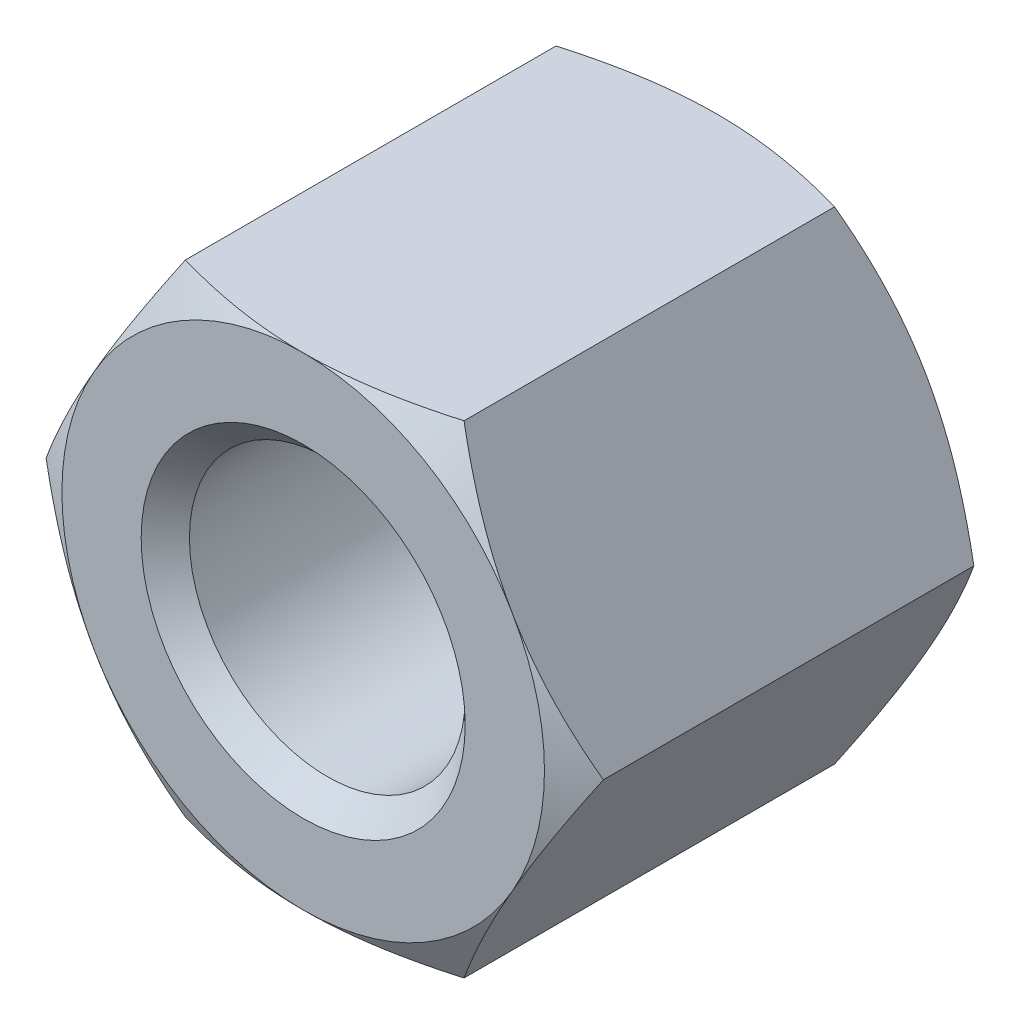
ISO-10303-21;
HEADER;
FILE_DESCRIPTION(('STEP AP214'),'2;1');
FILE_NAME('part.step','',(''),(''),'','','');
FILE_SCHEMA(('AUTOMOTIVE_DESIGN { 1 0 10303 214 1 1 1 1 }'));
ENDSEC;
DATA;
#1=APPLICATION_CONTEXT('core data for automotive mechanical design processes');
#2=APPLICATION_PROTOCOL_DEFINITION('international standard','automotive_design',2000,#1);
#3=PRODUCT_CONTEXT('',#1,'mechanical');
#4=PRODUCT('Part','Part','',(#3));
#5=PRODUCT_RELATED_PRODUCT_CATEGORY('part','',(#4));
#6=PRODUCT_DEFINITION_FORMATION('','',#4);
#7=PRODUCT_DEFINITION_CONTEXT('part definition',#1,'design');
#8=PRODUCT_DEFINITION('design','',#6,#7);
#9=PRODUCT_DEFINITION_SHAPE('','',#8);
#10=(LENGTH_UNIT() NAMED_UNIT(*) SI_UNIT(.MILLI.,.METRE.));
#11=(NAMED_UNIT(*) PLANE_ANGLE_UNIT() SI_UNIT($,.RADIAN.));
#12=(NAMED_UNIT(*) SI_UNIT($,.STERADIAN.) SOLID_ANGLE_UNIT());
#13=UNCERTAINTY_MEASURE_WITH_UNIT(LENGTH_MEASURE(1.E-05),#10,'distance_accuracy_value','');
#14=(GEOMETRIC_REPRESENTATION_CONTEXT(3) GLOBAL_UNCERTAINTY_ASSIGNED_CONTEXT((#13)) GLOBAL_UNIT_ASSIGNED_CONTEXT((#10,
#11,#12)) REPRESENTATION_CONTEXT('',''));
#15=CARTESIAN_POINT('',(0.,0.,0.));
#16=DIRECTION('',(0.,0.,1.));
#17=DIRECTION('',(1.,0.,0.));
#18=AXIS2_PLACEMENT_3D('',#15,#16,#17);
#19=CARTESIAN_POINT('',(4.04145188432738,0.,-3.));
#20=DIRECTION('',(0.866025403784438,0.5,0.));
#21=DIRECTION('',(-0.5,0.866025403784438,0.));
#22=AXIS2_PLACEMENT_3D('',#19,#20,#21);
#23=PLANE('',#22);
#24=CARTESIAN_POINT('',(4.04156735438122,-0.00019999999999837,2.68732593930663));
#25=CARTESIAN_POINT('',(3.9527667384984,0.153607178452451,2.73861421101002));
#26=CARTESIAN_POINT('',(3.86319960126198,0.308742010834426,2.7852590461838));
#27=CARTESIAN_POINT('',(3.68251437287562,0.621698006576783,2.86667812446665));
#28=CARTESIAN_POINT('',(3.59139307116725,0.779524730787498,2.90142356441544));
#29=CARTESIAN_POINT('',(3.41027974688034,1.09322221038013,2.95550997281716));
#30=CARTESIAN_POINT('',(3.32031559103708,1.24904469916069,2.97521091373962));
#31=CARTESIAN_POINT('',(3.13996396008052,1.56142288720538,2.99872986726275));
#32=CARTESIAN_POINT('',(3.04957714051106,1.71797745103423,3.00256735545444));
#33=CARTESIAN_POINT('',(2.88068384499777,2.01050921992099,2.99458469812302));
#34=CARTESIAN_POINT('',(2.80215208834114,2.14653021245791,2.98472456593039));
#35=CARTESIAN_POINT('',(2.64560020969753,2.417686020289,2.9534735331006));
#36=CARTESIAN_POINT('',(2.5675806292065,2.55281989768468,2.9320719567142));
#37=CARTESIAN_POINT('',(2.41070596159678,2.82453479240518,2.87856959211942));
#38=CARTESIAN_POINT('',(2.33187072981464,2.96108141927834,2.84624200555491));
#39=CARTESIAN_POINT('',(2.17537608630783,3.2321380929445,2.77287106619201));
#40=CARTESIAN_POINT('',(2.09771466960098,3.36665161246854,2.73184495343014));
#41=CARTESIAN_POINT('',(2.02061047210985,3.5002,2.68732593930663));
#42=B_SPLINE_CURVE_WITH_KNOTS('',3,(#24,#25,#26,#27,#28,#29,#30,#31,#32,#33,#34,#35,#36,#37,#38,
#39,#40,#41),.UNSPECIFIED.,.F.,.F.,(4,2,2,2,2,2,2,2,4),(0.,0.554793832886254,1.11092123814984,
1.65328467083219,2.19498204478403,2.6666513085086,3.13875761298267,3.62133612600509,
4.10296698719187),.UNSPECIFIED.);
#43=CARTESIAN_POINT('',(4.04145188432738,0.,2.68739260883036));
#44=VERTEX_POINT('',#43);
#45=CARTESIAN_POINT('',(3.03108891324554,1.75,3.));
#46=VERTEX_POINT('',#45);
#47=EDGE_CURVE('E127',#44,#46,#42,.T.);
#48=ORIENTED_EDGE('',*,*,#47,.F.);
#49=DIRECTION('',(0.,0.,1.));
#50=VECTOR('',#49,1.);
#51=CARTESIAN_POINT('',(4.04145188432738,0.,-3.));
#52=LINE('',#51,#50);
#53=CARTESIAN_POINT('',(4.04145188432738,0.,-2.68739260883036));
#54=VERTEX_POINT('',#53);
#55=EDGE_CURVE('E538',#54,#44,#52,.T.);
#56=ORIENTED_EDGE('',*,*,#55,.F.);
#57=CARTESIAN_POINT('',(4.04156735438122,-0.00019999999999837,-2.68732593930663));
#58=CARTESIAN_POINT('',(3.9527667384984,0.153607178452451,-2.73861421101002));
#59=CARTESIAN_POINT('',(3.86319960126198,0.308742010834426,-2.7852590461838));
#60=CARTESIAN_POINT('',(3.68251437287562,0.621698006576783,-2.86667812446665));
#61=CARTESIAN_POINT('',(3.59139307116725,0.779524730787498,-2.90142356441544));
#62=CARTESIAN_POINT('',(3.41027974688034,1.09322221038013,-2.95550997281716));
#63=CARTESIAN_POINT('',(3.32031559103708,1.24904469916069,-2.97521091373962));
#64=CARTESIAN_POINT('',(3.13996396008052,1.56142288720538,-2.99872986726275));
#65=CARTESIAN_POINT('',(3.04957714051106,1.71797745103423,-3.00256735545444));
#66=CARTESIAN_POINT('',(2.88068384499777,2.01050921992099,-2.99458469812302));
#67=CARTESIAN_POINT('',(2.80215208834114,2.14653021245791,-2.98472456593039));
#68=CARTESIAN_POINT('',(2.64560020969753,2.417686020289,-2.9534735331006));
#69=CARTESIAN_POINT('',(2.5675806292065,2.55281989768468,-2.9320719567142));
#70=CARTESIAN_POINT('',(2.41070596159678,2.82453479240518,-2.87856959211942));
#71=CARTESIAN_POINT('',(2.33187072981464,2.96108141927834,-2.84624200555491));
#72=CARTESIAN_POINT('',(2.17537608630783,3.2321380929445,-2.77287106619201));
#73=CARTESIAN_POINT('',(2.09771466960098,3.36665161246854,-2.73184495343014));
#74=CARTESIAN_POINT('',(2.02061047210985,3.5002,-2.68732593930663));
#75=B_SPLINE_CURVE_WITH_KNOTS('',3,(#57,#58,#59,#60,#61,#62,#63,#64,#65,#66,#67,#68,#69,#70,#71,
#72,#73,#74),.UNSPECIFIED.,.F.,.F.,(4,2,2,2,2,2,2,2,4),(0.,0.554793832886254,1.11092123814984,
1.65328467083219,2.19498204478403,2.6666513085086,3.13875761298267,3.62133612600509,
4.10296698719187),.UNSPECIFIED.);
#76=CARTESIAN_POINT('',(3.03108891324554,1.75,-3.));
#77=VERTEX_POINT('',#76);
#78=EDGE_CURVE('E615',#54,#77,#75,.T.);
#79=ORIENTED_EDGE('',*,*,#78,.T.);
#80=CARTESIAN_POINT('',(2.02072594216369,3.5,-2.68739260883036));
#81=VERTEX_POINT('',#80);
#82=EDGE_CURVE('E269',#77,#81,#75,.T.);
#83=ORIENTED_EDGE('',*,*,#82,.T.);
#84=DIRECTION('',(0.,0.,1.));
#85=VECTOR('',#84,1.);
#86=CARTESIAN_POINT('',(2.02072594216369,3.5,-3.));
#87=LINE('',#86,#85);
#88=CARTESIAN_POINT('',(2.02072594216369,3.5,2.68739260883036));
#89=VERTEX_POINT('',#88);
#90=EDGE_CURVE('E159',#81,#89,#87,.T.);
#91=ORIENTED_EDGE('',*,*,#90,.T.);
#92=EDGE_CURVE('E140',#46,#89,#42,.T.);
#93=ORIENTED_EDGE('',*,*,#92,.F.);
#94=EDGE_LOOP('',(#48,#56,#79,#83,#91,#93));
#95=FACE_BOUND('',#94,.T.);
#96=ADVANCED_FACE('F41',(#95),#23,.T.);
#97=CARTESIAN_POINT('',(2.02072594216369,-3.5,-3.));
#98=DIRECTION('',(0.866025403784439,-0.5,0.));
#99=DIRECTION('',(0.5,0.866025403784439,0.));
#100=AXIS2_PLACEMENT_3D('',#97,#98,#99);
#101=PLANE('',#100);
#102=CARTESIAN_POINT('',(2.02061047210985,-3.5002,2.68732593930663));
#103=CARTESIAN_POINT('',(2.10941108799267,-3.34639282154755,2.73861421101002));
#104=CARTESIAN_POINT('',(2.19897822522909,-3.19125798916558,2.7852590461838));
#105=CARTESIAN_POINT('',(2.37966345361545,-2.87830199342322,2.86667812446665));
#106=CARTESIAN_POINT('',(2.47078475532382,-2.7204752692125,2.90142356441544));
#107=CARTESIAN_POINT('',(2.65189807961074,-2.40677778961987,2.95550997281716));
#108=CARTESIAN_POINT('',(2.74186223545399,-2.25095530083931,2.97521091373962));
#109=CARTESIAN_POINT('',(2.92221386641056,-1.93857711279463,2.99872986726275));
#110=CARTESIAN_POINT('',(3.01260068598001,-1.78202254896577,3.00256735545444));
#111=CARTESIAN_POINT('',(3.1814939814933,-1.48949078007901,2.99458469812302));
#112=CARTESIAN_POINT('',(3.26002573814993,-1.35346978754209,2.98472456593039));
#113=CARTESIAN_POINT('',(3.41657761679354,-1.082313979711,2.9534735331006));
#114=CARTESIAN_POINT('',(3.49459719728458,-0.947180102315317,2.9320719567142));
#115=CARTESIAN_POINT('',(3.65147186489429,-0.675465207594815,2.87856959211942));
#116=CARTESIAN_POINT('',(3.73030709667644,-0.538918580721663,2.84624200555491));
#117=CARTESIAN_POINT('',(3.88680174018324,-0.267861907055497,2.77287106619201));
#118=CARTESIAN_POINT('',(3.96446315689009,-0.133348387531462,2.73184495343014));
#119=CARTESIAN_POINT('',(4.04156735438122,0.000200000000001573,2.68732593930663));
#120=B_SPLINE_CURVE_WITH_KNOTS('',3,(#102,#103,#104,#105,#106,#107,#108,#109,#110,#111,#112,
#113,#114,#115,#116,#117,#118,#119),.UNSPECIFIED.,.F.,.F.,(4,2,2,2,2,2,2,2,4),(0.,
0.554793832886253,1.11092123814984,1.65328467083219,2.19498204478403,2.6666513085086,
3.13875761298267,3.6213361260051,4.10296698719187),.UNSPECIFIED.);
#121=CARTESIAN_POINT('',(2.02072594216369,-3.5,2.68739260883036));
#122=VERTEX_POINT('',#121);
#123=CARTESIAN_POINT('',(3.03108891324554,-1.75,3.));
#124=VERTEX_POINT('',#123);
#125=EDGE_CURVE('E591',#122,#124,#120,.T.);
#126=ORIENTED_EDGE('',*,*,#125,.F.);
#127=DIRECTION('',(0.,0.,1.));
#128=VECTOR('',#127,1.);
#129=CARTESIAN_POINT('',(2.02072594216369,-3.5,-3.));
#130=LINE('',#129,#128);
#131=CARTESIAN_POINT('',(2.02072594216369,-3.5,-2.68739260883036));
#132=VERTEX_POINT('',#131);
#133=EDGE_CURVE('E283',#132,#122,#130,.T.);
#134=ORIENTED_EDGE('',*,*,#133,.F.);
#135=CARTESIAN_POINT('',(2.02061047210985,-3.5002,-2.68732593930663));
#136=CARTESIAN_POINT('',(2.10941108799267,-3.34639282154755,-2.73861421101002));
#137=CARTESIAN_POINT('',(2.19897822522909,-3.19125798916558,-2.7852590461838));
#138=CARTESIAN_POINT('',(2.37966345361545,-2.87830199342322,-2.86667812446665));
#139=CARTESIAN_POINT('',(2.47078475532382,-2.7204752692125,-2.90142356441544));
#140=CARTESIAN_POINT('',(2.65189807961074,-2.40677778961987,-2.95550997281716));
#141=CARTESIAN_POINT('',(2.74186223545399,-2.25095530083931,-2.97521091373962));
#142=CARTESIAN_POINT('',(2.92221386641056,-1.93857711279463,-2.99872986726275));
#143=CARTESIAN_POINT('',(3.01260068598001,-1.78202254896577,-3.00256735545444));
#144=CARTESIAN_POINT('',(3.1814939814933,-1.48949078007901,-2.99458469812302));
#145=CARTESIAN_POINT('',(3.26002573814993,-1.35346978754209,-2.98472456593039));
#146=CARTESIAN_POINT('',(3.41657761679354,-1.082313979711,-2.9534735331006));
#147=CARTESIAN_POINT('',(3.49459719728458,-0.947180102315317,-2.9320719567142));
#148=CARTESIAN_POINT('',(3.65147186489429,-0.675465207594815,-2.87856959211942));
#149=CARTESIAN_POINT('',(3.73030709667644,-0.538918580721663,-2.84624200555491));
#150=CARTESIAN_POINT('',(3.88680174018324,-0.267861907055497,-2.77287106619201));
#151=CARTESIAN_POINT('',(3.96446315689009,-0.133348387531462,-2.73184495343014));
#152=CARTESIAN_POINT('',(4.04156735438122,0.000200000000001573,-2.68732593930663));
#153=B_SPLINE_CURVE_WITH_KNOTS('',3,(#135,#136,#137,#138,#139,#140,#141,#142,#143,#144,#145,
#146,#147,#148,#149,#150,#151,#152),.UNSPECIFIED.,.F.,.F.,(4,2,2,2,2,2,2,2,4),(0.,
0.554793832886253,1.11092123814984,1.65328467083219,2.19498204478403,2.6666513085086,
3.13875761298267,3.6213361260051,4.10296698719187),.UNSPECIFIED.);
#154=CARTESIAN_POINT('',(3.03108891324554,-1.75,-3.));
#155=VERTEX_POINT('',#154);
#156=EDGE_CURVE('E553',#132,#155,#153,.T.);
#157=ORIENTED_EDGE('',*,*,#156,.T.);
#158=EDGE_CURVE('E284',#155,#54,#153,.T.);
#159=ORIENTED_EDGE('',*,*,#158,.T.);
#160=ORIENTED_EDGE('',*,*,#55,.T.);
#161=EDGE_CURVE('E132',#124,#44,#120,.T.);
#162=ORIENTED_EDGE('',*,*,#161,.F.);
#163=EDGE_LOOP('',(#126,#134,#157,#159,#160,#162));
#164=FACE_BOUND('',#163,.T.);
#165=ADVANCED_FACE('F254',(#164),#101,.T.);
#166=CARTESIAN_POINT('',(-2.02072594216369,-3.5,-3.));
#167=DIRECTION('',(0.,-1.,0.));
#168=DIRECTION('',(1.,0.,0.));
#169=AXIS2_PLACEMENT_3D('',#166,#167,#168);
#170=PLANE('',#169);
#171=CARTESIAN_POINT('',(-8.46638501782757,-3.5,-0.268561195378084));
#172=CARTESIAN_POINT('',(-8.27532704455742,-3.5,-0.166631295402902));
#173=CARTESIAN_POINT('',(-8.08406700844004,-3.5,-0.0650777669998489));
#174=CARTESIAN_POINT('',(-7.70104457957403,-3.5,0.137080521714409));
#175=CARTESIAN_POINT('',(-7.50928218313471,-3.5,0.237685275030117));
#176=CARTESIAN_POINT('',(-7.12495813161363,-3.5,0.437853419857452));
#177=CARTESIAN_POINT('',(-6.93239584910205,-3.5,0.537415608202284));
#178=CARTESIAN_POINT('',(-6.5465401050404,-3.5,0.735119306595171));
#179=CARTESIAN_POINT('',(-6.35324663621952,-3.5,0.83326080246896));
#180=CARTESIAN_POINT('',(-5.95543771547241,-3.5,1.03295034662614));
#181=CARTESIAN_POINT('',(-5.75087332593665,-3.5,1.13440110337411));
#182=CARTESIAN_POINT('',(-5.3405082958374,-3.5,1.33476036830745));
#183=CARTESIAN_POINT('',(-5.1347076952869,-3.5,1.43366895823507));
#184=CARTESIAN_POINT('',(-4.72163304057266,-3.5,1.62811118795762));
#185=CARTESIAN_POINT('',(-4.51435974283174,-3.5,1.72364642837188));
#186=CARTESIAN_POINT('',(-4.09777990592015,-3.5,1.91028515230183));
#187=CARTESIAN_POINT('',(-3.88847306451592,-3.5,2.00138796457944));
#188=CARTESIAN_POINT('',(-3.4519285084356,-3.5,2.18397379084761));
#189=CARTESIAN_POINT('',(-3.22449742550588,-3.5,2.2749988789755));
#190=CARTESIAN_POINT('',(-2.76594610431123,-3.5,2.44713557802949));
#191=CARTESIAN_POINT('',(-2.53482715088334,-3.5,2.52825055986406));
#192=CARTESIAN_POINT('',(-2.07240270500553,-3.5,2.67493190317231));
#193=CARTESIAN_POINT('',(-1.84118287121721,-3.5,2.74076256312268));
#194=CARTESIAN_POINT('',(-1.37409223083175,-3.5,2.85329331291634));
#195=CARTESIAN_POINT('',(-1.13822405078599,-3.5,2.90000389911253));
#196=CARTESIAN_POINT('',(-0.707379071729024,-3.5,2.9619614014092));
#197=CARTESIAN_POINT('',(-0.513036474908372,-3.5,2.98146824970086));
#198=CARTESIAN_POINT('',(-0.220865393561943,-3.5,2.99676068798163));
#199=CARTESIAN_POINT('',(-0.123371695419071,-3.5,2.99953046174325));
#200=CARTESIAN_POINT('',(0.0716423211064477,-3.5,3.00035918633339));
#201=CARTESIAN_POINT('',(0.169162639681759,-3.5,2.99841810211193));
#202=CARTESIAN_POINT('',(0.36569303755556,-3.5,2.98980184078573));
#203=CARTESIAN_POINT('',(0.464699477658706,-3.5,2.98304479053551));
#204=CARTESIAN_POINT('',(0.662289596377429,-3.5,2.96491207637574));
#205=CARTESIAN_POINT('',(0.760873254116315,-3.5,2.95353618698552));
#206=CARTESIAN_POINT('',(0.957461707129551,-3.5,2.92647864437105));
#207=CARTESIAN_POINT('',(1.05546639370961,-3.5,2.91079620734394));
#208=CARTESIAN_POINT('',(1.25075429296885,-3.5,2.8755154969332));
#209=CARTESIAN_POINT('',(1.34803755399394,-3.5,2.85591748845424));
#210=CARTESIAN_POINT('',(1.60644034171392,-3.5,2.798987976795));
#211=CARTESIAN_POINT('',(1.7668765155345,-3.5,2.75854486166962));
#212=CARTESIAN_POINT('',(2.08557665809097,-3.5,2.66983156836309));
#213=CARTESIAN_POINT('',(2.24383999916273,-3.5,2.62155917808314));
#214=CARTESIAN_POINT('',(2.55856095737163,-3.5,2.51876851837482));
#215=CARTESIAN_POINT('',(2.71501563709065,-3.5,2.46424133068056));
#216=CARTESIAN_POINT('',(3.02611627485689,-3.5,2.35033782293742));
#217=CARTESIAN_POINT('',(3.18076242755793,-3.5,2.29096203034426));
#218=CARTESIAN_POINT('',(3.48959375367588,-3.5,2.1679679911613));
#219=CARTESIAN_POINT('',(3.64376829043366,-3.5,2.10432317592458));
#220=CARTESIAN_POINT('',(3.95081833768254,-3.5,1.97397109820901));
#221=CARTESIAN_POINT('',(4.10369380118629,-3.5,1.9072637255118));
#222=CARTESIAN_POINT('',(4.40823556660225,-3.5,1.77145966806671));
#223=CARTESIAN_POINT('',(4.55990270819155,-3.5,1.70236486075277));
#224=CARTESIAN_POINT('',(4.86232527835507,-3.5,1.5622052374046));
#225=CARTESIAN_POINT('',(5.01308068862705,-3.5,1.49114038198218));
#226=CARTESIAN_POINT('',(5.44443417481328,-3.5,1.28500275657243));
#227=CARTESIAN_POINT('',(5.72408287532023,-3.5,1.14794462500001));
#228=CARTESIAN_POINT('',(6.28148920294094,-3.5,0.869922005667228));
#229=CARTESIAN_POINT('',(6.55924644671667,-3.5,0.728956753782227));
#230=CARTESIAN_POINT('',(7.10919659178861,-3.5,0.446335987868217));
#231=CARTESIAN_POINT('',(7.3814108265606,-3.5,0.304721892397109));
#232=CARTESIAN_POINT('',(7.92467418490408,-3.5,0.0194560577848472));
#233=CARTESIAN_POINT('',(8.19572361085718,-3.5,-0.124195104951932));
#234=CARTESIAN_POINT('',(8.46638501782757,-3.5,-0.268561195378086));
#235=B_SPLINE_CURVE_WITH_KNOTS('',3,(#171,#172,#173,#174,#175,#176,#177,#178,#179,#180,#181,
#182,#183,#184,#185,#186,#187,#188,#189,#190,#191,#192,#193,#194,#195,#196,#197,#198,#199,#200,
#201,#202,#203,#204,#205,#206,#207,#208,#209,#210,#211,#212,#213,#214,#215,#216,#217,#218,#219,
#220,#221,#222,#223,#224,#225,#226,#227,#228,#229,#230,#231,#232,#233,#234),.UNSPECIFIED.,.F.,
.F.,(4,2,2,2,2,2,2,2,2,2,2,2,2,2,2,2,2,2,2,2,2,2,2,2,2,2,2,2,2,2,2,4),(0.,0.649643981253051,
1.29929274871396,1.94962303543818,2.59995980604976,3.2849642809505,3.96994670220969,
4.65459961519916,5.3393558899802,6.07410963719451,6.80861275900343,7.52926879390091,
8.24952867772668,8.83460221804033,9.12710195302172,9.41960386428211,9.71720080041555,
10.0148122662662,10.3124779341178,10.6101234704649,11.1062167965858,11.6024505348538,
12.0994008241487,12.5962971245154,13.0966398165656,13.5970005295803,14.0969763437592,
14.5969621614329,15.531201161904,16.4656241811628,17.3861552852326,18.3064309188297),.UNSPECIFIED.);
#236=CARTESIAN_POINT('',(-2.02072594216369,-3.5,2.68739260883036));
#237=VERTEX_POINT('',#236);
#238=CARTESIAN_POINT('',(0.,-3.5,3.));
#239=VERTEX_POINT('',#238);
#240=EDGE_CURVE('E592',#237,#239,#235,.T.);
#241=ORIENTED_EDGE('',*,*,#240,.F.);
#242=DIRECTION('',(0.,0.,1.));
#243=VECTOR('',#242,1.);
#244=CARTESIAN_POINT('',(-2.02072594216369,-3.5,-3.));
#245=LINE('',#244,#243);
#246=CARTESIAN_POINT('',(-2.02072594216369,-3.5,-2.68739260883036));
#247=VERTEX_POINT('',#246);
#248=EDGE_CURVE('E539',#247,#237,#245,.T.);
#249=ORIENTED_EDGE('',*,*,#248,.F.);
#250=CARTESIAN_POINT('',(-6.98760919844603,-3.5,-0.508642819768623));
#251=CARTESIAN_POINT('',(-6.82517506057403,-3.5,-0.592482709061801));
#252=CARTESIAN_POINT('',(-6.66250896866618,-3.5,-0.67587703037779));
#253=CARTESIAN_POINT('',(-6.33660634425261,-3.5,-0.841550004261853));
#254=CARTESIAN_POINT('',(-6.17336980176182,-3.5,-0.923828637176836));
#255=CARTESIAN_POINT('',(-5.84596456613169,-3.5,-1.0871728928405));
#256=CARTESIAN_POINT('',(-5.68179480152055,-3.5,-1.16823637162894));
#257=CARTESIAN_POINT('',(-5.35264361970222,-3.5,-1.32870688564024));
#258=CARTESIAN_POINT('',(-5.18766219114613,-3.5,-1.40811389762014));
#259=CARTESIAN_POINT('',(-4.84789951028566,-3.5,-1.56905051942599));
#260=CARTESIAN_POINT('',(-4.67306478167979,-3.5,-1.65046754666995));
#261=CARTESIAN_POINT('',(-4.32207597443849,-3.5,-1.81039274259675));
#262=CARTESIAN_POINT('',(-4.14592196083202,-3.5,-1.88890105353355));
#263=CARTESIAN_POINT('',(-3.79209812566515,-3.5,-2.04211814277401));
#264=CARTESIAN_POINT('',(-3.61442937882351,-3.5,-2.11682938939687));
#265=CARTESIAN_POINT('',(-3.25705926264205,-3.5,-2.26136794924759));
#266=CARTESIAN_POINT('',(-3.07735744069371,-3.5,-2.33119414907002));
#267=CARTESIAN_POINT('',(-2.68778922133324,-3.5,-2.47459645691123));
#268=CARTESIAN_POINT('',(-2.47752382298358,-3.5,-2.54710497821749));
#269=CARTESIAN_POINT('',(-2.05330224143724,-3.5,-2.68018776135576));
#270=CARTESIAN_POINT('',(-1.83934794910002,-3.5,-2.74076795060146));
#271=CARTESIAN_POINT('',(-1.41152497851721,-3.5,-2.84467100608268));
#272=CARTESIAN_POINT('',(-1.19773505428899,-3.5,-2.88830566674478));
#273=CARTESIAN_POINT('',(-0.874755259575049,-3.5,-2.93870567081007));
#274=CARTESIAN_POINT('',(-0.766723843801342,-3.5,-2.95299632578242));
#275=CARTESIAN_POINT('',(-0.550084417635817,-3.5,-2.97611705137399));
#276=CARTESIAN_POINT('',(-0.441476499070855,-3.5,-2.98494796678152));
#277=CARTESIAN_POINT('',(-0.222371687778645,-3.5,-2.99691888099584));
#278=CARTESIAN_POINT('',(-0.111870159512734,-3.5,-2.99997488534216));
#279=CARTESIAN_POINT('',(0.109133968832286,-3.5,-3.00002480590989));
#280=CARTESIAN_POINT('',(0.21963656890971,-3.5,-2.99701873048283));
#281=CARTESIAN_POINT('',(0.440337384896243,-3.5,-2.98505858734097));
#282=CARTESIAN_POINT('',(0.550535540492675,-3.5,-2.97610341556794));
#283=CARTESIAN_POINT('',(0.770337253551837,-3.5,-2.95257548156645));
#284=CARTESIAN_POINT('',(0.879940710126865,-3.5,-2.93800179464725));
#285=CARTESIAN_POINT('',(1.21195228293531,-3.5,-2.88586256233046));
#286=CARTESIAN_POINT('',(1.43309852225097,-3.5,-2.8401503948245));
#287=CARTESIAN_POINT('',(1.87122687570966,-3.5,-2.73220142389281));
#288=CARTESIAN_POINT('',(2.08820751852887,-3.5,-2.66995889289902));
#289=CARTESIAN_POINT('',(2.51331372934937,-3.5,-2.53503494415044));
#290=CARTESIAN_POINT('',(2.72152801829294,-3.5,-2.46262842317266));
#291=CARTESIAN_POINT('',(3.13489298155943,-3.5,-2.30948868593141));
#292=CARTESIAN_POINT('',(3.34004283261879,-3.5,-2.22875327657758));
#293=CARTESIAN_POINT('',(3.74807710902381,-3.5,-2.06113521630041));
#294=CARTESIAN_POINT('',(3.95095858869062,-3.5,-1.97424545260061));
#295=CARTESIAN_POINT('',(4.3547116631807,-3.5,-1.79599819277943));
#296=CARTESIAN_POINT('',(4.55558347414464,-3.5,-1.70464118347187));
#297=CARTESIAN_POINT('',(4.94413135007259,-3.5,-1.52396665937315));
#298=CARTESIAN_POINT('',(5.13189606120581,-3.5,-1.43483900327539));
#299=CARTESIAN_POINT('',(5.50630892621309,-3.5,-1.25425712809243));
#300=CARTESIAN_POINT('',(5.69295704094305,-3.5,-1.16280282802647));
#301=CARTESIAN_POINT('',(6.06470033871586,-3.5,-0.978385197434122));
#302=CARTESIAN_POINT('',(6.24979865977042,-3.5,-0.885428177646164));
#303=CARTESIAN_POINT('',(6.61923262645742,-3.5,-0.698049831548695));
#304=CARTESIAN_POINT('',(6.80356833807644,-3.5,-0.603628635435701));
#305=CARTESIAN_POINT('',(6.98760919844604,-3.5,-0.508642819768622));
#306=B_SPLINE_CURVE_WITH_KNOTS('',3,(#250,#251,#252,#253,#254,#255,#256,#257,#258,#259,#260,
#261,#262,#263,#264,#265,#266,#267,#268,#269,#270,#271,#272,#273,#274,#275,#276,#277,#278,#279,
#280,#281,#282,#283,#284,#285,#286,#287,#288,#289,#290,#291,#292,#293,#294,#295,#296,#297,#298,
#299,#300,#301,#302,#303,#304,#305),.UNSPECIFIED.,.F.,.F.,(4,2,2,2,2,2,2,2,2,2,2,2,2,2,2,2,2,2,
2,2,2,2,2,2,2,2,2,4),(0.,0.548386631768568,1.09678291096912,1.64605384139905,2.19533247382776,
2.77389895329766,3.35243709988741,3.93059422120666,4.50888269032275,5.17587089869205,
5.84252682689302,6.4962584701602,6.82305844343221,7.14980783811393,7.48127418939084,
7.81274008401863,8.14426751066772,8.4758495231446,9.1523678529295,9.82912089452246,
10.4902132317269,11.1514800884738,11.81352407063,12.4754960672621,13.0990099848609,
13.7225456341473,14.3439254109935,14.9652502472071),.UNSPECIFIED.);
#307=CARTESIAN_POINT('',(0.,-3.5,-3.));
#308=VERTEX_POINT('',#307);
#309=EDGE_CURVE('E536',#247,#308,#306,.T.);
#310=ORIENTED_EDGE('',*,*,#309,.T.);
#311=EDGE_CURVE('E259',#308,#132,#306,.T.);
#312=ORIENTED_EDGE('',*,*,#311,.T.);
#313=ORIENTED_EDGE('',*,*,#133,.T.);
#314=EDGE_CURVE('E138',#239,#122,#235,.T.);
#315=ORIENTED_EDGE('',*,*,#314,.F.);
#316=EDGE_LOOP('',(#241,#249,#310,#312,#313,#315));
#317=FACE_BOUND('',#316,.T.);
#318=ADVANCED_FACE('F292',(#317),#170,.T.);
#319=CARTESIAN_POINT('',(-4.04145188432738,0.,-3.));
#320=DIRECTION('',(-0.866025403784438,-0.5,0.));
#321=DIRECTION('',(0.5,-0.866025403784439,0.));
#322=AXIS2_PLACEMENT_3D('',#319,#320,#321);
#323=PLANE('',#322);
#324=CARTESIAN_POINT('',(-4.04156735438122,0.000199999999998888,2.68732593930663));
#325=CARTESIAN_POINT('',(-3.9527667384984,-0.153607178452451,2.73861421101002));
#326=CARTESIAN_POINT('',(-3.86319960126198,-0.308742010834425,2.78525904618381));
#327=CARTESIAN_POINT('',(-3.68251437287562,-0.621698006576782,2.86667812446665));
#328=CARTESIAN_POINT('',(-3.59139307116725,-0.779524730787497,2.90142356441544));
#329=CARTESIAN_POINT('',(-3.41027974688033,-1.09322221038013,2.95550997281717));
#330=CARTESIAN_POINT('',(-3.32031559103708,-1.24904469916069,2.97521091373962));
#331=CARTESIAN_POINT('',(-3.13996396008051,-1.56142288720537,2.99872986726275));
#332=CARTESIAN_POINT('',(-3.04957714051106,-1.71797745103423,3.00256735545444));
#333=CARTESIAN_POINT('',(-2.88068384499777,-2.01050921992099,2.99458469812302));
#334=CARTESIAN_POINT('',(-2.80215208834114,-2.14653021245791,2.98472456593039));
#335=CARTESIAN_POINT('',(-2.64560020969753,-2.417686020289,2.9534735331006));
#336=CARTESIAN_POINT('',(-2.56758062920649,-2.55281989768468,2.9320719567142));
#337=CARTESIAN_POINT('',(-2.41070596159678,-2.82453479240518,2.87856959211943));
#338=CARTESIAN_POINT('',(-2.33187072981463,-2.96108141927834,2.84624200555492));
#339=CARTESIAN_POINT('',(-2.17537608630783,-3.2321380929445,2.77287106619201));
#340=CARTESIAN_POINT('',(-2.09771466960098,-3.36665161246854,2.73184495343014));
#341=CARTESIAN_POINT('',(-2.02061047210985,-3.5002,2.68732593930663));
#342=B_SPLINE_CURVE_WITH_KNOTS('',3,(#324,#325,#326,#327,#328,#329,#330,#331,#332,#333,#334,
#335,#336,#337,#338,#339,#340,#341),.UNSPECIFIED.,.F.,.F.,(4,2,2,2,2,2,2,2,4),(0.,
0.554793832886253,1.11092123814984,1.65328467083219,2.19498204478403,2.6666513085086,
3.13875761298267,3.6213361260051,4.10296698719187),.UNSPECIFIED.);
#343=CARTESIAN_POINT('',(-4.04145188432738,0.,2.68739260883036));
#344=VERTEX_POINT('',#343);
#345=CARTESIAN_POINT('',(-3.03108891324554,-1.75,3.));
#346=VERTEX_POINT('',#345);
#347=EDGE_CURVE('E176',#344,#346,#342,.T.);
#348=ORIENTED_EDGE('',*,*,#347,.F.);
#349=DIRECTION('',(0.,0.,1.));
#350=VECTOR('',#349,1.);
#351=CARTESIAN_POINT('',(-4.04145188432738,0.,-3.));
#352=LINE('',#351,#350);
#353=CARTESIAN_POINT('',(-4.04145188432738,0.,-2.68739260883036));
#354=VERTEX_POINT('',#353);
#355=EDGE_CURVE('E543',#354,#344,#352,.T.);
#356=ORIENTED_EDGE('',*,*,#355,.F.);
#357=CARTESIAN_POINT('',(-4.04156735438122,0.000199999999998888,-2.68732593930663));
#358=CARTESIAN_POINT('',(-3.9527667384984,-0.153607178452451,-2.73861421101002));
#359=CARTESIAN_POINT('',(-3.86319960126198,-0.308742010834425,-2.78525904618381));
#360=CARTESIAN_POINT('',(-3.68251437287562,-0.621698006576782,-2.86667812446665));
#361=CARTESIAN_POINT('',(-3.59139307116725,-0.779524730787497,-2.90142356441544));
#362=CARTESIAN_POINT('',(-3.41027974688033,-1.09322221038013,-2.95550997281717));
#363=CARTESIAN_POINT('',(-3.32031559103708,-1.24904469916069,-2.97521091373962));
#364=CARTESIAN_POINT('',(-3.13996396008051,-1.56142288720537,-2.99872986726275));
#365=CARTESIAN_POINT('',(-3.04957714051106,-1.71797745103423,-3.00256735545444));
#366=CARTESIAN_POINT('',(-2.88068384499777,-2.01050921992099,-2.99458469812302));
#367=CARTESIAN_POINT('',(-2.80215208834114,-2.14653021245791,-2.98472456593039));
#368=CARTESIAN_POINT('',(-2.64560020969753,-2.417686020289,-2.9534735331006));
#369=CARTESIAN_POINT('',(-2.56758062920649,-2.55281989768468,-2.9320719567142));
#370=CARTESIAN_POINT('',(-2.41070596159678,-2.82453479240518,-2.87856959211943));
#371=CARTESIAN_POINT('',(-2.33187072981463,-2.96108141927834,-2.84624200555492));
#372=CARTESIAN_POINT('',(-2.17537608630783,-3.2321380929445,-2.77287106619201));
#373=CARTESIAN_POINT('',(-2.09771466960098,-3.36665161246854,-2.73184495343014));
#374=CARTESIAN_POINT('',(-2.02061047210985,-3.5002,-2.68732593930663));
#375=B_SPLINE_CURVE_WITH_KNOTS('',3,(#357,#358,#359,#360,#361,#362,#363,#364,#365,#366,#367,
#368,#369,#370,#371,#372,#373,#374),.UNSPECIFIED.,.F.,.F.,(4,2,2,2,2,2,2,2,4),(0.,
0.554793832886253,1.11092123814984,1.65328467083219,2.19498204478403,2.6666513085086,
3.13875761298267,3.6213361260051,4.10296698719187),.UNSPECIFIED.);
#376=CARTESIAN_POINT('',(-3.03108891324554,-1.75,-3.));
#377=VERTEX_POINT('',#376);
#378=EDGE_CURVE('E275',#354,#377,#375,.T.);
#379=ORIENTED_EDGE('',*,*,#378,.T.);
#380=EDGE_CURVE('E282',#377,#247,#375,.T.);
#381=ORIENTED_EDGE('',*,*,#380,.T.);
#382=ORIENTED_EDGE('',*,*,#248,.T.);
#383=EDGE_CURVE('E593',#346,#237,#342,.T.);
#384=ORIENTED_EDGE('',*,*,#383,.F.);
#385=EDGE_LOOP('',(#348,#356,#379,#381,#382,#384));
#386=FACE_BOUND('',#385,.T.);
#387=ADVANCED_FACE('F289',(#386),#323,.T.);
#388=CARTESIAN_POINT('',(-2.02072594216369,3.5,-3.));
#389=DIRECTION('',(-0.866025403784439,0.5,0.));
#390=DIRECTION('',(-0.5,-0.866025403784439,0.));
#391=AXIS2_PLACEMENT_3D('',#388,#389,#390);
#392=PLANE('',#391);
#393=CARTESIAN_POINT('',(-2.02061047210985,3.5002,2.68732593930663));
#394=CARTESIAN_POINT('',(-2.10941108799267,3.34639282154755,2.73861421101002));
#395=CARTESIAN_POINT('',(-2.19897822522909,3.19125798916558,2.78525904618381));
#396=CARTESIAN_POINT('',(-2.37966345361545,2.87830199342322,2.86667812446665));
#397=CARTESIAN_POINT('',(-2.47078475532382,2.7204752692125,2.90142356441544));
#398=CARTESIAN_POINT('',(-2.65189807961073,2.40677778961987,2.95550997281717));
#399=CARTESIAN_POINT('',(-2.74186223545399,2.25095530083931,2.97521091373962));
#400=CARTESIAN_POINT('',(-2.92221386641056,1.93857711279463,2.99872986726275));
#401=CARTESIAN_POINT('',(-3.01260068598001,1.78202254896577,3.00256735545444));
#402=CARTESIAN_POINT('',(-3.1814939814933,1.48949078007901,2.99458469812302));
#403=CARTESIAN_POINT('',(-3.26002573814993,1.35346978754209,2.98472456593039));
#404=CARTESIAN_POINT('',(-3.41657761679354,1.082313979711,2.9534735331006));
#405=CARTESIAN_POINT('',(-3.49459719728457,0.947180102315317,2.9320719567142));
#406=CARTESIAN_POINT('',(-3.65147186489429,0.675465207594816,2.87856959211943));
#407=CARTESIAN_POINT('',(-3.73030709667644,0.538918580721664,2.84624200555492));
#408=CARTESIAN_POINT('',(-3.88680174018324,0.267861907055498,2.77287106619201));
#409=CARTESIAN_POINT('',(-3.96446315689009,0.133348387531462,2.73184495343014));
#410=CARTESIAN_POINT('',(-4.04156735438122,-0.000200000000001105,2.68732593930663));
#411=B_SPLINE_CURVE_WITH_KNOTS('',3,(#393,#394,#395,#396,#397,#398,#399,#400,#401,#402,#403,
#404,#405,#406,#407,#408,#409,#410),.UNSPECIFIED.,.F.,.F.,(4,2,2,2,2,2,2,2,4),(0.,
0.554793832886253,1.11092123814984,1.65328467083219,2.19498204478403,2.6666513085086,
3.13875761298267,3.6213361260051,4.10296698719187),.UNSPECIFIED.);
#412=CARTESIAN_POINT('',(-2.02072594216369,3.5,2.68739260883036));
#413=VERTEX_POINT('',#412);
#414=CARTESIAN_POINT('',(-3.03108891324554,1.75,3.));
#415=VERTEX_POINT('',#414);
#416=EDGE_CURVE('E183',#413,#415,#411,.T.);
#417=ORIENTED_EDGE('',*,*,#416,.F.);
#418=DIRECTION('',(0.,0.,1.));
#419=VECTOR('',#418,1.);
#420=CARTESIAN_POINT('',(-2.02072594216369,3.5,-3.));
#421=LINE('',#420,#419);
#422=CARTESIAN_POINT('',(-2.02072594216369,3.5,-2.68739260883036));
#423=VERTEX_POINT('',#422);
#424=EDGE_CURVE('E233',#423,#413,#421,.T.);
#425=ORIENTED_EDGE('',*,*,#424,.F.);
#426=CARTESIAN_POINT('',(-2.02061047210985,3.5002,-2.68732593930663));
#427=CARTESIAN_POINT('',(-2.10941108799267,3.34639282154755,-2.73861421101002));
#428=CARTESIAN_POINT('',(-2.19897822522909,3.19125798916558,-2.78525904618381));
#429=CARTESIAN_POINT('',(-2.37966345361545,2.87830199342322,-2.86667812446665));
#430=CARTESIAN_POINT('',(-2.47078475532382,2.7204752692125,-2.90142356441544));
#431=CARTESIAN_POINT('',(-2.65189807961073,2.40677778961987,-2.95550997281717));
#432=CARTESIAN_POINT('',(-2.74186223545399,2.25095530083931,-2.97521091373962));
#433=CARTESIAN_POINT('',(-2.92221386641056,1.93857711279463,-2.99872986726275));
#434=CARTESIAN_POINT('',(-3.01260068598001,1.78202254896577,-3.00256735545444));
#435=CARTESIAN_POINT('',(-3.1814939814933,1.48949078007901,-2.99458469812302));
#436=CARTESIAN_POINT('',(-3.26002573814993,1.35346978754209,-2.98472456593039));
#437=CARTESIAN_POINT('',(-3.41657761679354,1.082313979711,-2.9534735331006));
#438=CARTESIAN_POINT('',(-3.49459719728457,0.947180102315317,-2.9320719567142));
#439=CARTESIAN_POINT('',(-3.65147186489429,0.675465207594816,-2.87856959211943));
#440=CARTESIAN_POINT('',(-3.73030709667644,0.538918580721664,-2.84624200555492));
#441=CARTESIAN_POINT('',(-3.88680174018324,0.267861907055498,-2.77287106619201));
#442=CARTESIAN_POINT('',(-3.96446315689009,0.133348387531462,-2.73184495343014));
#443=CARTESIAN_POINT('',(-4.04156735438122,-0.000200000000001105,-2.68732593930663));
#444=B_SPLINE_CURVE_WITH_KNOTS('',3,(#426,#427,#428,#429,#430,#431,#432,#433,#434,#435,#436,
#437,#438,#439,#440,#441,#442,#443),.UNSPECIFIED.,.F.,.F.,(4,2,2,2,2,2,2,2,4),(0.,
0.554793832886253,1.11092123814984,1.65328467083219,2.19498204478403,2.6666513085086,
3.13875761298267,3.6213361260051,4.10296698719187),.UNSPECIFIED.);
#445=CARTESIAN_POINT('',(-3.03108891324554,1.75,-3.));
#446=VERTEX_POINT('',#445);
#447=EDGE_CURVE('E237',#423,#446,#444,.T.);
#448=ORIENTED_EDGE('',*,*,#447,.T.);
#449=EDGE_CURVE('E547',#446,#354,#444,.T.);
#450=ORIENTED_EDGE('',*,*,#449,.T.);
#451=ORIENTED_EDGE('',*,*,#355,.T.);
#452=EDGE_CURVE('E528',#415,#344,#411,.T.);
#453=ORIENTED_EDGE('',*,*,#452,.F.);
#454=EDGE_LOOP('',(#417,#425,#448,#450,#451,#453));
#455=FACE_BOUND('',#454,.T.);
#456=ADVANCED_FACE('F218',(#455),#392,.T.);
#457=CARTESIAN_POINT('',(2.02072594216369,3.5,-3.));
#458=DIRECTION('',(0.,1.,0.));
#459=DIRECTION('',(0.,0.,1.));
#460=AXIS2_PLACEMENT_3D('',#457,#458,#459);
#461=PLANE('',#460);
#462=CARTESIAN_POINT('',(8.46638501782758,3.5,-0.26856119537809));
#463=CARTESIAN_POINT('',(8.27532704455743,3.5,-0.166631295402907));
#464=CARTESIAN_POINT('',(8.08406700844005,3.5,-0.0650777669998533));
#465=CARTESIAN_POINT('',(7.70104457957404,3.5,0.137080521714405));
#466=CARTESIAN_POINT('',(7.50928218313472,3.5,0.237685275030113));
#467=CARTESIAN_POINT('',(7.12495813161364,3.5,0.437853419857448));
#468=CARTESIAN_POINT('',(6.93239584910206,3.5,0.53741560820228));
#469=CARTESIAN_POINT('',(6.54654010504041,3.5,0.735119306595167));
#470=CARTESIAN_POINT('',(6.35324663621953,3.5,0.833260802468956));
#471=CARTESIAN_POINT('',(5.95543771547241,3.5,1.03295034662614));
#472=CARTESIAN_POINT('',(5.75087332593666,3.5,1.13440110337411));
#473=CARTESIAN_POINT('',(5.34050829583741,3.5,1.33476036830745));
#474=CARTESIAN_POINT('',(5.13470769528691,3.5,1.43366895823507));
#475=CARTESIAN_POINT('',(4.72163304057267,3.5,1.62811118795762));
#476=CARTESIAN_POINT('',(4.51435974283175,3.5,1.72364642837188));
#477=CARTESIAN_POINT('',(4.09777990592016,3.5,1.91028515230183));
#478=CARTESIAN_POINT('',(3.88847306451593,3.5,2.00138796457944));
#479=CARTESIAN_POINT('',(3.45192850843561,3.5,2.18397379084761));
#480=CARTESIAN_POINT('',(3.22449742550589,3.5,2.2749988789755));
#481=CARTESIAN_POINT('',(2.76594610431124,3.5,2.44713557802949));
#482=CARTESIAN_POINT('',(2.53482715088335,3.5,2.52825055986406));
#483=CARTESIAN_POINT('',(2.07240270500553,3.5,2.67493190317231));
#484=CARTESIAN_POINT('',(1.84118287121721,3.5,2.74076256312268));
#485=CARTESIAN_POINT('',(1.37409223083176,3.5,2.85329331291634));
#486=CARTESIAN_POINT('',(1.138224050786,3.5,2.90000389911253));
#487=CARTESIAN_POINT('',(0.707379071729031,3.5,2.9619614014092));
#488=CARTESIAN_POINT('',(0.513036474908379,3.5,2.98146824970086));
#489=CARTESIAN_POINT('',(0.22086539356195,3.5,2.99676068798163));
#490=CARTESIAN_POINT('',(0.123371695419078,3.5,2.99953046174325));
#491=CARTESIAN_POINT('',(-0.0716423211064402,3.5,3.00035918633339));
#492=CARTESIAN_POINT('',(-0.169162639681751,3.5,2.99841810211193));
#493=CARTESIAN_POINT('',(-0.365693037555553,3.5,2.98980184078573));
#494=CARTESIAN_POINT('',(-0.464699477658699,3.5,2.98304479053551));
#495=CARTESIAN_POINT('',(-0.662289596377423,3.5,2.96491207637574));
#496=CARTESIAN_POINT('',(-0.760873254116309,3.5,2.95353618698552));
#497=CARTESIAN_POINT('',(-0.957461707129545,3.5,2.92647864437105));
#498=CARTESIAN_POINT('',(-1.0554663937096,3.5,2.91079620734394));
#499=CARTESIAN_POINT('',(-1.25075429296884,3.5,2.8755154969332));
#500=CARTESIAN_POINT('',(-1.34803755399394,3.5,2.85591748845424));
#501=CARTESIAN_POINT('',(-1.60644034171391,3.5,2.798987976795));
#502=CARTESIAN_POINT('',(-1.7668765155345,3.5,2.75854486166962));
#503=CARTESIAN_POINT('',(-2.08557665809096,3.5,2.66983156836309));
#504=CARTESIAN_POINT('',(-2.24383999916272,3.5,2.62155917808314));
#505=CARTESIAN_POINT('',(-2.55856095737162,3.5,2.51876851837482));
#506=CARTESIAN_POINT('',(-2.71501563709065,3.5,2.46424133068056));
#507=CARTESIAN_POINT('',(-3.02611627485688,3.5,2.35033782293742));
#508=CARTESIAN_POINT('',(-3.18076242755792,3.5,2.29096203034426));
#509=CARTESIAN_POINT('',(-3.48959375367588,3.5,2.1679679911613));
#510=CARTESIAN_POINT('',(-3.64376829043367,3.5,2.10432317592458));
#511=CARTESIAN_POINT('',(-3.95081833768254,3.5,1.97397109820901));
#512=CARTESIAN_POINT('',(-4.10369380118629,3.5,1.9072637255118));
#513=CARTESIAN_POINT('',(-4.40823556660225,3.5,1.77145966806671));
#514=CARTESIAN_POINT('',(-4.55990270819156,3.5,1.70236486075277));
#515=CARTESIAN_POINT('',(-4.86232527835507,3.5,1.5622052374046));
#516=CARTESIAN_POINT('',(-5.01308068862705,3.5,1.49114038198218));
#517=CARTESIAN_POINT('',(-5.44443417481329,3.5,1.28500275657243));
#518=CARTESIAN_POINT('',(-5.72408287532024,3.5,1.147944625));
#519=CARTESIAN_POINT('',(-6.28148920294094,3.5,0.869922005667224));
#520=CARTESIAN_POINT('',(-6.55924644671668,3.5,0.728956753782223));
#521=CARTESIAN_POINT('',(-7.10919659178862,3.5,0.446335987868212));
#522=CARTESIAN_POINT('',(-7.38141082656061,3.5,0.304721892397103));
#523=CARTESIAN_POINT('',(-7.9246741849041,3.5,0.0194560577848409));
#524=CARTESIAN_POINT('',(-8.19572361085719,3.5,-0.124195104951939));
#525=CARTESIAN_POINT('',(-8.46638501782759,3.5,-0.268561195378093));
#526=B_SPLINE_CURVE_WITH_KNOTS('',3,(#462,#463,#464,#465,#466,#467,#468,#469,#470,#471,#472,
#473,#474,#475,#476,#477,#478,#479,#480,#481,#482,#483,#484,#485,#486,#487,#488,#489,#490,#491,
#492,#493,#494,#495,#496,#497,#498,#499,#500,#501,#502,#503,#504,#505,#506,#507,#508,#509,#510,
#511,#512,#513,#514,#515,#516,#517,#518,#519,#520,#521,#522,#523,#524,#525),.UNSPECIFIED.,.F.,
.F.,(4,2,2,2,2,2,2,2,2,2,2,2,2,2,2,2,2,2,2,2,2,2,2,2,2,2,2,2,2,2,2,4),(0.,0.649643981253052,
1.29929274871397,1.94962303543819,2.59995980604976,3.2849642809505,3.96994670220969,
4.65459961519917,5.33935588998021,6.07410963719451,6.80861275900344,7.52926879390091,
8.24952867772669,8.83460221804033,9.12710195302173,9.41960386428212,9.71720080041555,
10.0148122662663,10.3124779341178,10.6101234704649,11.1062167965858,11.6024505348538,
12.0994008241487,12.5962971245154,13.0966398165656,13.5970005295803,14.0969763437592,
14.596962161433,15.531201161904,16.4656241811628,17.3861552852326,18.3064309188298),.UNSPECIFIED.);
#527=CARTESIAN_POINT('',(0.,3.5,3.));
#528=VERTEX_POINT('',#527);
#529=EDGE_CURVE('E145',#89,#528,#526,.T.);
#530=ORIENTED_EDGE('',*,*,#529,.F.);
#531=ORIENTED_EDGE('',*,*,#90,.F.);
#532=CARTESIAN_POINT('',(6.98760919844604,3.5,-0.508642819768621));
#533=CARTESIAN_POINT('',(6.82517506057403,3.5,-0.5924827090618));
#534=CARTESIAN_POINT('',(6.66250896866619,3.5,-0.675877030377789));
#535=CARTESIAN_POINT('',(6.33660634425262,3.5,-0.841550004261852));
#536=CARTESIAN_POINT('',(6.17336980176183,3.5,-0.923828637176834));
#537=CARTESIAN_POINT('',(5.84596456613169,3.5,-1.0871728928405));
#538=CARTESIAN_POINT('',(5.68179480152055,3.5,-1.16823637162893));
#539=CARTESIAN_POINT('',(5.35264361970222,3.5,-1.32870688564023));
#540=CARTESIAN_POINT('',(5.18766219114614,3.5,-1.40811389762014));
#541=CARTESIAN_POINT('',(4.84789951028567,3.5,-1.56905051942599));
#542=CARTESIAN_POINT('',(4.67306478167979,3.5,-1.65046754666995));
#543=CARTESIAN_POINT('',(4.3220759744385,3.5,-1.81039274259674));
#544=CARTESIAN_POINT('',(4.14592196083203,3.5,-1.88890105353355));
#545=CARTESIAN_POINT('',(3.79209812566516,3.5,-2.04211814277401));
#546=CARTESIAN_POINT('',(3.61442937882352,3.5,-2.11682938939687));
#547=CARTESIAN_POINT('',(3.25705926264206,3.5,-2.26136794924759));
#548=CARTESIAN_POINT('',(3.07735744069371,3.5,-2.33119414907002));
#549=CARTESIAN_POINT('',(2.68778922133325,3.5,-2.47459645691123));
#550=CARTESIAN_POINT('',(2.47752382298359,3.5,-2.54710497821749));
#551=CARTESIAN_POINT('',(2.05330224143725,3.5,-2.68018776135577));
#552=CARTESIAN_POINT('',(1.83934794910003,3.5,-2.74076795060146));
#553=CARTESIAN_POINT('',(1.41152497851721,3.5,-2.84467100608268));
#554=CARTESIAN_POINT('',(1.197735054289,3.5,-2.88830566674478));
#555=CARTESIAN_POINT('',(0.874755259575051,3.5,-2.93870567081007));
#556=CARTESIAN_POINT('',(0.766723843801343,3.5,-2.95299632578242));
#557=CARTESIAN_POINT('',(0.550084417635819,3.5,-2.976117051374));
#558=CARTESIAN_POINT('',(0.441476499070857,3.5,-2.98494796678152));
#559=CARTESIAN_POINT('',(0.222371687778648,3.5,-2.99691888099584));
#560=CARTESIAN_POINT('',(0.111870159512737,3.5,-2.99997488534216));
#561=CARTESIAN_POINT('',(-0.109133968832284,3.5,-3.0000248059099));
#562=CARTESIAN_POINT('',(-0.219636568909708,3.5,-2.99701873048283));
#563=CARTESIAN_POINT('',(-0.440337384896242,3.5,-2.98505858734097));
#564=CARTESIAN_POINT('',(-0.550535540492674,3.5,-2.97610341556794));
#565=CARTESIAN_POINT('',(-0.770337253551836,3.5,-2.95257548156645));
#566=CARTESIAN_POINT('',(-0.879940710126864,3.5,-2.93800179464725));
#567=CARTESIAN_POINT('',(-1.21195228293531,3.5,-2.88586256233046));
#568=CARTESIAN_POINT('',(-1.43309852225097,3.5,-2.8401503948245));
#569=CARTESIAN_POINT('',(-1.87122687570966,3.5,-2.73220142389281));
#570=CARTESIAN_POINT('',(-2.08820751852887,3.5,-2.66995889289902));
#571=CARTESIAN_POINT('',(-2.51331372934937,3.5,-2.53503494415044));
#572=CARTESIAN_POINT('',(-2.72152801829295,3.5,-2.46262842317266));
#573=CARTESIAN_POINT('',(-3.13489298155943,3.5,-2.30948868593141));
#574=CARTESIAN_POINT('',(-3.34004283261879,3.5,-2.22875327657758));
#575=CARTESIAN_POINT('',(-3.74807710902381,3.5,-2.06113521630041));
#576=CARTESIAN_POINT('',(-3.95095858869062,3.5,-1.97424545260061));
#577=CARTESIAN_POINT('',(-4.3547116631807,3.5,-1.79599819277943));
#578=CARTESIAN_POINT('',(-4.55558347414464,3.5,-1.70464118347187));
#579=CARTESIAN_POINT('',(-4.9441313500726,3.5,-1.52396665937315));
#580=CARTESIAN_POINT('',(-5.13189606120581,3.5,-1.43483900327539));
#581=CARTESIAN_POINT('',(-5.50630892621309,3.5,-1.25425712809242));
#582=CARTESIAN_POINT('',(-5.69295704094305,3.5,-1.16280282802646));
#583=CARTESIAN_POINT('',(-6.06470033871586,3.5,-0.97838519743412));
#584=CARTESIAN_POINT('',(-6.24979865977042,3.5,-0.885428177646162));
#585=CARTESIAN_POINT('',(-6.61923262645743,3.5,-0.698049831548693));
#586=CARTESIAN_POINT('',(-6.80356833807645,3.5,-0.6036286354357));
#587=CARTESIAN_POINT('',(-6.98760919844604,3.5,-0.508642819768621));
#588=B_SPLINE_CURVE_WITH_KNOTS('',3,(#532,#533,#534,#535,#536,#537,#538,#539,#540,#541,#542,
#543,#544,#545,#546,#547,#548,#549,#550,#551,#552,#553,#554,#555,#556,#557,#558,#559,#560,#561,
#562,#563,#564,#565,#566,#567,#568,#569,#570,#571,#572,#573,#574,#575,#576,#577,#578,#579,#580,
#581,#582,#583,#584,#585,#586,#587),.UNSPECIFIED.,.F.,.F.,(4,2,2,2,2,2,2,2,2,2,2,2,2,2,2,2,2,2,
2,2,2,2,2,2,2,2,2,4),(0.,0.548386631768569,1.09678291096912,1.64605384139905,2.19533247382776,
2.77389895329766,3.35243709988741,3.93059422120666,4.50888269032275,5.17587089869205,
5.84252682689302,6.4962584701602,6.82305844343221,7.14980783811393,7.48127418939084,
7.81274008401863,8.14426751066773,8.47584952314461,9.1523678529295,9.82912089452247,
10.4902132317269,11.1514800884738,11.81352407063,12.4754960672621,13.0990099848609,
13.7225456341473,14.3439254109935,14.9652502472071),.UNSPECIFIED.);
#589=CARTESIAN_POINT('',(0.,3.5,-3.));
#590=VERTEX_POINT('',#589);
#591=EDGE_CURVE('E234',#81,#590,#588,.T.);
#592=ORIENTED_EDGE('',*,*,#591,.T.);
#593=EDGE_CURVE('E223',#590,#423,#588,.T.);
#594=ORIENTED_EDGE('',*,*,#593,.T.);
#595=ORIENTED_EDGE('',*,*,#424,.T.);
#596=EDGE_CURVE('E161',#528,#413,#526,.T.);
#597=ORIENTED_EDGE('',*,*,#596,.F.);
#598=EDGE_LOOP('',(#530,#531,#592,#594,#595,#597));
#599=FACE_BOUND('',#598,.T.);
#600=ADVANCED_FACE('F214',(#599),#461,.T.);
#601=CARTESIAN_POINT('',(0.,0.,-3.));
#602=DIRECTION('',(0.,0.,1.));
#603=DIRECTION('',(-1.,0.,0.));
#604=AXIS2_PLACEMENT_3D('',#601,#602,#603);
#605=CONICAL_SURFACE('',#604,3.5,1.0471975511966);
#606=CARTESIAN_POINT('',(0.,0.,-3.));
#607=DIRECTION('',(0.,0.,1.));
#608=DIRECTION('',(1.,0.,0.));
#609=AXIS2_PLACEMENT_3D('',#606,#607,#608);
#610=CIRCLE('',#609,3.5);
#611=EDGE_CURVE('E551',#155,#77,#610,.T.);
#612=ORIENTED_EDGE('',*,*,#611,.T.);
#613=ORIENTED_EDGE('',*,*,#78,.F.);
#614=ORIENTED_EDGE('',*,*,#158,.F.);
#615=EDGE_LOOP('',(#612,#613,#614));
#616=FACE_BOUND('',#615,.T.);
#617=ADVANCED_FACE('F217',(#616),#605,.T.);
#618=EDGE_CURVE('E555',#308,#155,#610,.T.);
#619=ORIENTED_EDGE('',*,*,#618,.T.);
#620=ORIENTED_EDGE('',*,*,#156,.F.);
#621=ORIENTED_EDGE('',*,*,#311,.F.);
#622=EDGE_LOOP('',(#619,#620,#621));
#623=FACE_BOUND('',#622,.T.);
#624=ADVANCED_FACE('F337',(#623),#605,.T.);
#625=ORIENTED_EDGE('',*,*,#380,.F.);
#626=EDGE_CURVE('E562',#377,#308,#610,.T.);
#627=ORIENTED_EDGE('',*,*,#626,.T.);
#628=ORIENTED_EDGE('',*,*,#309,.F.);
#629=EDGE_LOOP('',(#625,#627,#628));
#630=FACE_BOUND('',#629,.T.);
#631=ADVANCED_FACE('F251',(#630),#605,.T.);
#632=ORIENTED_EDGE('',*,*,#449,.F.);
#633=EDGE_CURVE('E566',#446,#377,#610,.T.);
#634=ORIENTED_EDGE('',*,*,#633,.T.);
#635=ORIENTED_EDGE('',*,*,#378,.F.);
#636=EDGE_LOOP('',(#632,#634,#635));
#637=FACE_BOUND('',#636,.T.);
#638=ADVANCED_FACE('F249',(#637),#605,.T.);
#639=ORIENTED_EDGE('',*,*,#593,.F.);
#640=CARTESIAN_POINT('',(0.,0.,-3.));
#641=DIRECTION('',(0.,0.,-1.));
#642=DIRECTION('',(-1.,0.,0.));
#643=AXIS2_PLACEMENT_3D('',#640,#641,#642);
#644=CIRCLE('',#643,3.5);
#645=EDGE_CURVE('E235',#446,#590,#644,.T.);
#646=ORIENTED_EDGE('',*,*,#645,.F.);
#647=ORIENTED_EDGE('',*,*,#447,.F.);
#648=EDGE_LOOP('',(#639,#646,#647));
#649=FACE_BOUND('',#648,.T.);
#650=ADVANCED_FACE('F243',(#649),#605,.T.);
#651=EDGE_CURVE('E556',#77,#590,#610,.T.);
#652=ORIENTED_EDGE('',*,*,#651,.T.);
#653=ORIENTED_EDGE('',*,*,#591,.F.);
#654=ORIENTED_EDGE('',*,*,#82,.F.);
#655=EDGE_LOOP('',(#652,#653,#654));
#656=FACE_BOUND('',#655,.T.);
#657=ADVANCED_FACE('F248',(#656),#605,.T.);
#658=CARTESIAN_POINT('',(0.,0.,-3.));
#659=DIRECTION('',(0.,0.,1.));
#660=DIRECTION('',(1.,0.,0.));
#661=AXIS2_PLACEMENT_3D('',#658,#659,#660);
#662=PLANE('',#661);
#663=CARTESIAN_POINT('',(0.,0.,-3.));
#664=DIRECTION('',(0.,0.,1.));
#665=DIRECTION('',(1.,0.,0.));
#666=AXIS2_PLACEMENT_3D('',#663,#664,#665);
#667=CIRCLE('',#666,2.35);
#668=CARTESIAN_POINT('',(2.35,0.,-3.));
#669=VERTEX_POINT('',#668);
#670=EDGE_CURVE('E565',#669,#669,#667,.T.);
#671=ORIENTED_EDGE('',*,*,#670,.T.);
#672=EDGE_LOOP('',(#671));
#673=FACE_BOUND('',#672,.T.);
#674=ORIENTED_EDGE('',*,*,#651,.F.);
#675=ORIENTED_EDGE('',*,*,#611,.F.);
#676=ORIENTED_EDGE('',*,*,#618,.F.);
#677=ORIENTED_EDGE('',*,*,#626,.F.);
#678=ORIENTED_EDGE('',*,*,#633,.F.);
#679=ORIENTED_EDGE('',*,*,#645,.T.);
#680=EDGE_LOOP('',(#674,#675,#676,#677,#678,#679));
#681=FACE_BOUND('',#680,.T.);
#682=ADVANCED_FACE('F371',(#673,#681),#662,.F.);
#683=CARTESIAN_POINT('',(0.,0.,0.));
#684=DIRECTION('',(0.,0.,-1.));
#685=DIRECTION('',(-1.,0.,0.));
#686=AXIS2_PLACEMENT_3D('',#683,#684,#685);
#687=CYLINDRICAL_SURFACE('',#686,2.);
#688=CARTESIAN_POINT('',(0.,0.,2.65));
#689=DIRECTION('',(0.,0.,-1.));
#690=DIRECTION('',(-1.,0.,0.));
#691=AXIS2_PLACEMENT_3D('',#688,#689,#690);
#692=CIRCLE('',#691,2.);
#693=CARTESIAN_POINT('',(-2.,0.,2.65));
#694=VERTEX_POINT('',#693);
#695=EDGE_CURVE('E12',#694,#694,#692,.F.);
#696=ORIENTED_EDGE('',*,*,#695,.T.);
#697=EDGE_LOOP('',(#696));
#698=FACE_BOUND('',#697,.T.);
#699=CARTESIAN_POINT('',(0.,0.,-2.65));
#700=DIRECTION('',(0.,0.,1.));
#701=DIRECTION('',(1.,0.,0.));
#702=AXIS2_PLACEMENT_3D('',#699,#700,#701);
#703=CIRCLE('',#702,2.);
#704=CARTESIAN_POINT('',(2.,0.,-2.65));
#705=VERTEX_POINT('',#704);
#706=EDGE_CURVE('E603',#705,#705,#703,.F.);
#707=ORIENTED_EDGE('',*,*,#706,.T.);
#708=EDGE_LOOP('',(#707));
#709=FACE_BOUND('',#708,.T.);
#710=ADVANCED_FACE('F252',(#698,#709),#687,.F.);
#711=CARTESIAN_POINT('',(0.,0.,-2.65));
#712=DIRECTION('',(0.,0.,-1.));
#713=DIRECTION('',(-1.,0.,0.));
#714=AXIS2_PLACEMENT_3D('',#711,#712,#713);
#715=CONICAL_SURFACE('',#714,2.,0.785398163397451);
#716=ORIENTED_EDGE('',*,*,#670,.F.);
#717=EDGE_LOOP('',(#716));
#718=FACE_BOUND('',#717,.T.);
#719=ORIENTED_EDGE('',*,*,#706,.F.);
#720=EDGE_LOOP('',(#719));
#721=FACE_BOUND('',#720,.T.);
#722=ADVANCED_FACE('F386',(#718,#721),#715,.F.);
#723=CARTESIAN_POINT('',(0.,0.,3.));
#724=DIRECTION('',(0.,0.,-1.));
#725=DIRECTION('',(-1.,0.,0.));
#726=AXIS2_PLACEMENT_3D('',#723,#724,#725);
#727=CONICAL_SURFACE('',#726,3.5,1.0471975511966);
#728=ORIENTED_EDGE('',*,*,#347,.T.);
#729=CARTESIAN_POINT('',(0.,0.,3.));
#730=DIRECTION('',(0.,0.,-1.));
#731=DIRECTION('',(-1.,0.,0.));
#732=AXIS2_PLACEMENT_3D('',#729,#730,#731);
#733=CIRCLE('',#732,3.5);
#734=EDGE_CURVE('E149',#415,#346,#733,.F.);
#735=ORIENTED_EDGE('',*,*,#734,.F.);
#736=ORIENTED_EDGE('',*,*,#452,.T.);
#737=EDGE_LOOP('',(#728,#735,#736));
#738=FACE_BOUND('',#737,.T.);
#739=ADVANCED_FACE('F194',(#738),#727,.T.);
#740=ORIENTED_EDGE('',*,*,#416,.T.);
#741=CARTESIAN_POINT('',(0.,0.,3.));
#742=DIRECTION('',(0.,0.,-1.));
#743=DIRECTION('',(-1.,0.,0.));
#744=AXIS2_PLACEMENT_3D('',#741,#742,#743);
#745=CIRCLE('',#744,3.5);
#746=EDGE_CURVE('E167',#415,#528,#745,.T.);
#747=ORIENTED_EDGE('',*,*,#746,.T.);
#748=ORIENTED_EDGE('',*,*,#596,.T.);
#749=EDGE_LOOP('',(#740,#747,#748));
#750=FACE_BOUND('',#749,.T.);
#751=ADVANCED_FACE('F191',(#750),#727,.T.);
#752=ORIENTED_EDGE('',*,*,#92,.T.);
#753=ORIENTED_EDGE('',*,*,#529,.T.);
#754=EDGE_CURVE('E59',#46,#528,#733,.F.);
#755=ORIENTED_EDGE('',*,*,#754,.F.);
#756=EDGE_LOOP('',(#752,#753,#755));
#757=FACE_BOUND('',#756,.T.);
#758=ADVANCED_FACE('F143',(#757),#727,.T.);
#759=ORIENTED_EDGE('',*,*,#161,.T.);
#760=ORIENTED_EDGE('',*,*,#47,.T.);
#761=EDGE_CURVE('E129',#124,#46,#733,.F.);
#762=ORIENTED_EDGE('',*,*,#761,.F.);
#763=EDGE_LOOP('',(#759,#760,#762));
#764=FACE_BOUND('',#763,.T.);
#765=ADVANCED_FACE('F128',(#764),#727,.T.);
#766=ORIENTED_EDGE('',*,*,#314,.T.);
#767=ORIENTED_EDGE('',*,*,#125,.T.);
#768=EDGE_CURVE('E154',#239,#124,#733,.F.);
#769=ORIENTED_EDGE('',*,*,#768,.F.);
#770=EDGE_LOOP('',(#766,#767,#769));
#771=FACE_BOUND('',#770,.T.);
#772=ADVANCED_FACE('F420',(#771),#727,.T.);
#773=ORIENTED_EDGE('',*,*,#240,.T.);
#774=EDGE_CURVE('E612',#346,#239,#733,.F.);
#775=ORIENTED_EDGE('',*,*,#774,.F.);
#776=ORIENTED_EDGE('',*,*,#383,.T.);
#777=EDGE_LOOP('',(#773,#775,#776));
#778=FACE_BOUND('',#777,.T.);
#779=ADVANCED_FACE('F196',(#778),#727,.T.);
#780=CARTESIAN_POINT('',(0.,0.,3.));
#781=DIRECTION('',(0.,0.,-1.));
#782=DIRECTION('',(1.,0.,0.));
#783=AXIS2_PLACEMENT_3D('',#780,#781,#782);
#784=PLANE('',#783);
#785=CARTESIAN_POINT('',(0.,0.,3.));
#786=DIRECTION('',(0.,0.,-1.));
#787=DIRECTION('',(-1.,0.,0.));
#788=AXIS2_PLACEMENT_3D('',#785,#786,#787);
#789=CIRCLE('',#788,2.35000000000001);
#790=CARTESIAN_POINT('',(-2.35000000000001,0.,3.));
#791=VERTEX_POINT('',#790);
#792=EDGE_CURVE('E51',#791,#791,#789,.T.);
#793=ORIENTED_EDGE('',*,*,#792,.T.);
#794=EDGE_LOOP('',(#793));
#795=FACE_BOUND('',#794,.T.);
#796=ORIENTED_EDGE('',*,*,#734,.T.);
#797=ORIENTED_EDGE('',*,*,#774,.T.);
#798=ORIENTED_EDGE('',*,*,#768,.T.);
#799=ORIENTED_EDGE('',*,*,#761,.T.);
#800=ORIENTED_EDGE('',*,*,#754,.T.);
#801=ORIENTED_EDGE('',*,*,#746,.F.);
#802=EDGE_LOOP('',(#796,#797,#798,#799,#800,#801));
#803=FACE_BOUND('',#802,.T.);
#804=ADVANCED_FACE('F151',(#795,#803),#784,.F.);
#805=CARTESIAN_POINT('',(0.,0.,3.));
#806=DIRECTION('',(0.,0.,1.));
#807=DIRECTION('',(1.,0.,0.));
#808=AXIS2_PLACEMENT_3D('',#805,#806,#807);
#809=CONICAL_SURFACE('',#808,2.35000000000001,0.785398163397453);
#810=ORIENTED_EDGE('',*,*,#695,.F.);
#811=EDGE_LOOP('',(#810));
#812=FACE_BOUND('',#811,.T.);
#813=ORIENTED_EDGE('',*,*,#792,.F.);
#814=EDGE_LOOP('',(#813));
#815=FACE_BOUND('',#814,.T.);
#816=ADVANCED_FACE('F43',(#812,#815),#809,.F.);
#817=CLOSED_SHELL('',(#96,#165,#318,#387,#456,#600,#617,#624,#631,#638,#650,#657,#682,#710,#722,
#739,#751,#758,#765,#772,#779,#804,#816));
#818=MANIFOLD_SOLID_BREP('B2',#817);
#819=ADVANCED_BREP_SHAPE_REPRESENTATION('',(#18,#818),#14);
#820=SHAPE_DEFINITION_REPRESENTATION(#9,#819);
ENDSEC;
END-ISO-10303-21;
